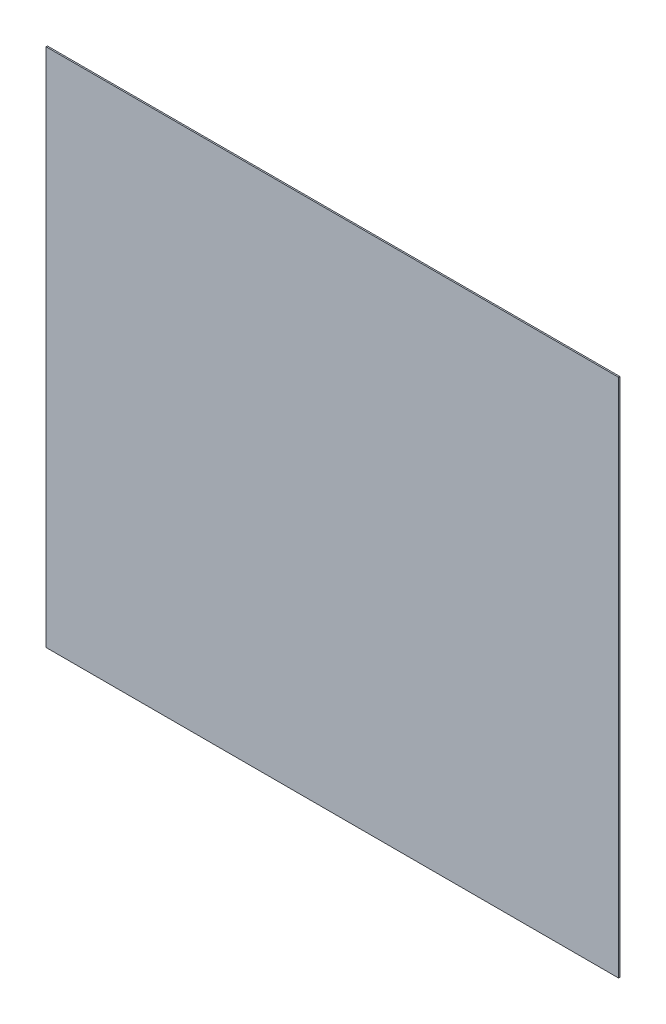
ISO-10303-21;
HEADER;
FILE_DESCRIPTION(('STEP AP214'),'2;1');
FILE_NAME('part.step','',(''),(''),'','','');
FILE_SCHEMA(('AUTOMOTIVE_DESIGN { 1 0 10303 214 1 1 1 1 }'));
ENDSEC;
DATA;
#1=APPLICATION_CONTEXT('core data for automotive mechanical design processes');
#2=APPLICATION_PROTOCOL_DEFINITION('international standard','automotive_design',2000,#1);
#3=PRODUCT_CONTEXT('',#1,'mechanical');
#4=PRODUCT('Part','Part','',(#3));
#5=PRODUCT_RELATED_PRODUCT_CATEGORY('part','',(#4));
#6=PRODUCT_DEFINITION_FORMATION('','',#4);
#7=PRODUCT_DEFINITION_CONTEXT('part definition',#1,'design');
#8=PRODUCT_DEFINITION('design','',#6,#7);
#9=PRODUCT_DEFINITION_SHAPE('','',#8);
#10=(LENGTH_UNIT() NAMED_UNIT(*) SI_UNIT(.MILLI.,.METRE.));
#11=(NAMED_UNIT(*) PLANE_ANGLE_UNIT() SI_UNIT($,.RADIAN.));
#12=(NAMED_UNIT(*) SI_UNIT($,.STERADIAN.) SOLID_ANGLE_UNIT());
#13=UNCERTAINTY_MEASURE_WITH_UNIT(LENGTH_MEASURE(1.E-05),#10,'distance_accuracy_value','');
#14=(GEOMETRIC_REPRESENTATION_CONTEXT(3) GLOBAL_UNCERTAINTY_ASSIGNED_CONTEXT((#13)) GLOBAL_UNIT_ASSIGNED_CONTEXT((#10,
#11,#12)) REPRESENTATION_CONTEXT('',''));
#15=CARTESIAN_POINT('',(0.,0.,0.));
#16=DIRECTION('',(0.,0.,1.));
#17=DIRECTION('',(1.,0.,0.));
#18=AXIS2_PLACEMENT_3D('',#15,#16,#17);
#19=CARTESIAN_POINT('',(822.384567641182,464.304711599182,0.5));
#20=DIRECTION('',(0.,1.,0.));
#21=DIRECTION('',(0.,0.,1.));
#22=AXIS2_PLACEMENT_3D('',#19,#20,#21);
#23=PLANE('',#22);
#24=DIRECTION('',(1.,0.,0.));
#25=VECTOR('',#24,1.);
#26=CARTESIAN_POINT('',(822.384567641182,464.304711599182,0.5));
#27=LINE('',#26,#25);
#28=CARTESIAN_POINT('',(823.384567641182,464.304711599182,0.5));
#29=VERTEX_POINT('',#28);
#30=CARTESIAN_POINT('',(1032.38456764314,464.304711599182,0.5));
#31=VERTEX_POINT('',#30);
#32=EDGE_CURVE('E91',#29,#31,#27,.T.);
#33=ORIENTED_EDGE('',*,*,#32,.F.);
#34=DIRECTION('',(0.,0.,-1.));
#35=VECTOR('',#34,1.);
#36=CARTESIAN_POINT('',(823.384567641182,464.304711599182,0.5));
#37=LINE('',#36,#35);
#38=CARTESIAN_POINT('',(823.384567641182,464.304711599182,0.));
#39=VERTEX_POINT('',#38);
#40=EDGE_CURVE('E96',#29,#39,#37,.T.);
#41=ORIENTED_EDGE('',*,*,#40,.T.);
#42=DIRECTION('',(1.,0.,0.));
#43=VECTOR('',#42,1.);
#44=CARTESIAN_POINT('',(822.384567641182,464.304711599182,0.));
#45=LINE('',#44,#43);
#46=CARTESIAN_POINT('',(1032.38456764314,464.304711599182,0.));
#47=VERTEX_POINT('',#46);
#48=EDGE_CURVE('E83',#39,#47,#45,.T.);
#49=ORIENTED_EDGE('',*,*,#48,.T.);
#50=DIRECTION('',(0.,0.,-1.));
#51=VECTOR('',#50,1.);
#52=CARTESIAN_POINT('',(1032.38456764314,464.304711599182,0.5));
#53=LINE('',#52,#51);
#54=EDGE_CURVE('E45',#31,#47,#53,.T.);
#55=ORIENTED_EDGE('',*,*,#54,.F.);
#56=EDGE_LOOP('',(#33,#41,#49,#55));
#57=FACE_BOUND('',#56,.T.);
#58=ADVANCED_FACE('F38',(#57),#23,.F.);
#59=CARTESIAN_POINT('',(1032.38456764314,464.304711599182,0.5));
#60=DIRECTION('',(-1.,0.,0.));
#61=DIRECTION('',(0.,0.,1.));
#62=AXIS2_PLACEMENT_3D('',#59,#60,#61);
#63=PLANE('',#62);
#64=DIRECTION('',(0.,1.,0.));
#65=VECTOR('',#64,1.);
#66=CARTESIAN_POINT('',(1032.38456764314,464.304711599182,0.));
#67=LINE('',#66,#65);
#68=CARTESIAN_POINT('',(1032.38456764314,654.304711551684,0.));
#69=VERTEX_POINT('',#68);
#70=EDGE_CURVE('E73',#47,#69,#67,.T.);
#71=ORIENTED_EDGE('',*,*,#70,.T.);
#72=DIRECTION('',(0.,0.,-1.));
#73=VECTOR('',#72,1.);
#74=CARTESIAN_POINT('',(1032.38456764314,654.304711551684,0.5));
#75=LINE('',#74,#73);
#76=CARTESIAN_POINT('',(1032.38456764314,654.304711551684,0.5));
#77=VERTEX_POINT('',#76);
#78=EDGE_CURVE('E76',#77,#69,#75,.T.);
#79=ORIENTED_EDGE('',*,*,#78,.F.);
#80=DIRECTION('',(0.,1.,0.));
#81=VECTOR('',#80,1.);
#82=CARTESIAN_POINT('',(1032.38456764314,464.304711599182,0.5));
#83=LINE('',#82,#81);
#84=EDGE_CURVE('E60',#31,#77,#83,.T.);
#85=ORIENTED_EDGE('',*,*,#84,.F.);
#86=ORIENTED_EDGE('',*,*,#54,.T.);
#87=EDGE_LOOP('',(#71,#79,#85,#86));
#88=FACE_BOUND('',#87,.T.);
#89=ADVANCED_FACE('F75',(#88),#63,.F.);
#90=CARTESIAN_POINT('',(1032.38456764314,654.304711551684,0.5));
#91=DIRECTION('',(0.,-1.,0.));
#92=DIRECTION('',(0.,0.,-1.));
#93=AXIS2_PLACEMENT_3D('',#90,#91,#92);
#94=PLANE('',#93);
#95=DIRECTION('',(-1.,0.,0.));
#96=VECTOR('',#95,1.);
#97=CARTESIAN_POINT('',(1032.38456764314,654.304711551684,0.));
#98=LINE('',#97,#96);
#99=CARTESIAN_POINT('',(823.384567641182,654.304711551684,0.));
#100=VERTEX_POINT('',#99);
#101=EDGE_CURVE('E82',#69,#100,#98,.T.);
#102=ORIENTED_EDGE('',*,*,#101,.T.);
#103=DIRECTION('',(0.,0.,1.));
#104=VECTOR('',#103,1.);
#105=CARTESIAN_POINT('',(823.384567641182,654.304711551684,0.5));
#106=LINE('',#105,#104);
#107=CARTESIAN_POINT('',(823.384567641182,654.304711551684,0.5));
#108=VERTEX_POINT('',#107);
#109=EDGE_CURVE('E52',#100,#108,#106,.T.);
#110=ORIENTED_EDGE('',*,*,#109,.T.);
#111=DIRECTION('',(-1.,0.,0.));
#112=VECTOR('',#111,1.);
#113=CARTESIAN_POINT('',(1032.38456764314,654.304711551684,0.5));
#114=LINE('',#113,#112);
#115=EDGE_CURVE('E88',#77,#108,#114,.T.);
#116=ORIENTED_EDGE('',*,*,#115,.F.);
#117=ORIENTED_EDGE('',*,*,#78,.T.);
#118=EDGE_LOOP('',(#102,#110,#116,#117));
#119=FACE_BOUND('',#118,.T.);
#120=ADVANCED_FACE('F87',(#119),#94,.F.);
#121=CARTESIAN_POINT('',(0.,0.,0.5));
#122=DIRECTION('',(0.,0.,1.));
#123=DIRECTION('',(1.,0.,0.));
#124=AXIS2_PLACEMENT_3D('',#121,#122,#123);
#125=PLANE('',#124);
#126=DIRECTION('',(0.,1.,0.));
#127=VECTOR('',#126,1.);
#128=CARTESIAN_POINT('',(823.384567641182,659.702583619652,0.5));
#129=LINE('',#128,#127);
#130=EDGE_CURVE('E102',#29,#108,#129,.T.);
#131=ORIENTED_EDGE('',*,*,#130,.F.);
#132=ORIENTED_EDGE('',*,*,#32,.T.);
#133=ORIENTED_EDGE('',*,*,#84,.T.);
#134=ORIENTED_EDGE('',*,*,#115,.T.);
#135=EDGE_LOOP('',(#131,#132,#133,#134));
#136=FACE_BOUND('',#135,.T.);
#137=ADVANCED_FACE('F110',(#136),#125,.T.);
#138=CARTESIAN_POINT('',(0.,0.,0.));
#139=DIRECTION('',(0.,0.,1.));
#140=DIRECTION('',(1.,0.,0.));
#141=AXIS2_PLACEMENT_3D('',#138,#139,#140);
#142=PLANE('',#141);
#143=ORIENTED_EDGE('',*,*,#48,.F.);
#144=DIRECTION('',(0.,1.,0.));
#145=VECTOR('',#144,1.);
#146=CARTESIAN_POINT('',(823.384567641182,0.,0.));
#147=LINE('',#146,#145);
#148=EDGE_CURVE('E11',#39,#100,#147,.T.);
#149=ORIENTED_EDGE('',*,*,#148,.T.);
#150=ORIENTED_EDGE('',*,*,#101,.F.);
#151=ORIENTED_EDGE('',*,*,#70,.F.);
#152=EDGE_LOOP('',(#143,#149,#150,#151));
#153=FACE_BOUND('',#152,.T.);
#154=ADVANCED_FACE('F90',(#153),#142,.F.);
#155=CARTESIAN_POINT('',(823.384567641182,659.702583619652,0.));
#156=DIRECTION('',(1.,0.,0.));
#157=DIRECTION('',(0.,0.,-1.));
#158=AXIS2_PLACEMENT_3D('',#155,#156,#157);
#159=PLANE('',#158);
#160=ORIENTED_EDGE('',*,*,#130,.T.);
#161=ORIENTED_EDGE('',*,*,#109,.F.);
#162=ORIENTED_EDGE('',*,*,#148,.F.);
#163=ORIENTED_EDGE('',*,*,#40,.F.);
#164=EDGE_LOOP('',(#160,#161,#162,#163));
#165=FACE_BOUND('',#164,.T.);
#166=ADVANCED_FACE('F106',(#165),#159,.F.);
#167=CLOSED_SHELL('',(#58,#89,#120,#137,#154,#166));
#168=MANIFOLD_SOLID_BREP('B2',#167);
#169=ADVANCED_BREP_SHAPE_REPRESENTATION('',(#18,#168),#14);
#170=SHAPE_DEFINITION_REPRESENTATION(#9,#169);
ENDSEC;
END-ISO-10303-21;
